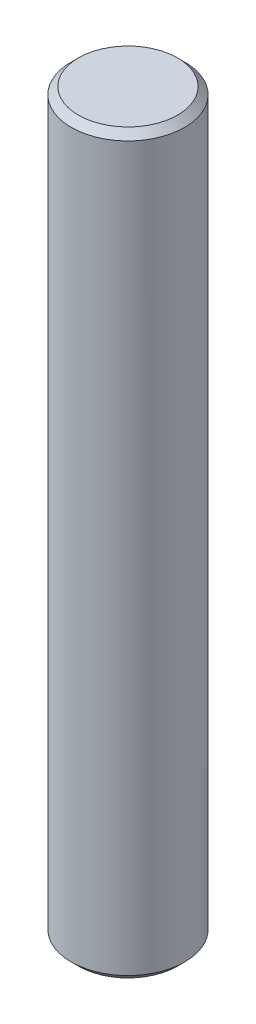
from build123d import *

# Parameters (mm, degrees)
ESQUISSE1_W     = 4
ESQUISSE1_H     = 52
CHANFREIN1_SIZE = 0.5


with BuildPart() as part:
    # Esquisse1 → Base-R_volution (revolve)
    with BuildSketch(Plane.XY, mode=Mode.PRIVATE) as base_r_volution_sk:
        with Locations((-2, 0)):
            Rectangle(ESQUISSE1_W, ESQUISSE1_H)
    revolve(base_r_volution_sk.sketch.rotate(Axis((0, 26, 0), (0, -1, 0)), 270), axis=Axis((0, 26, 0), (0, -1, 0)))

    # Chanfrein1
    chanfrein1_edges = [part.edges().sort_by_distance(p)[0] for p in [
        (0, 26, -4),
        (0, -26, -4),
    ]]
    chamfer(chanfrein1_edges, length=CHANFREIN1_SIZE)


solid = part.part
